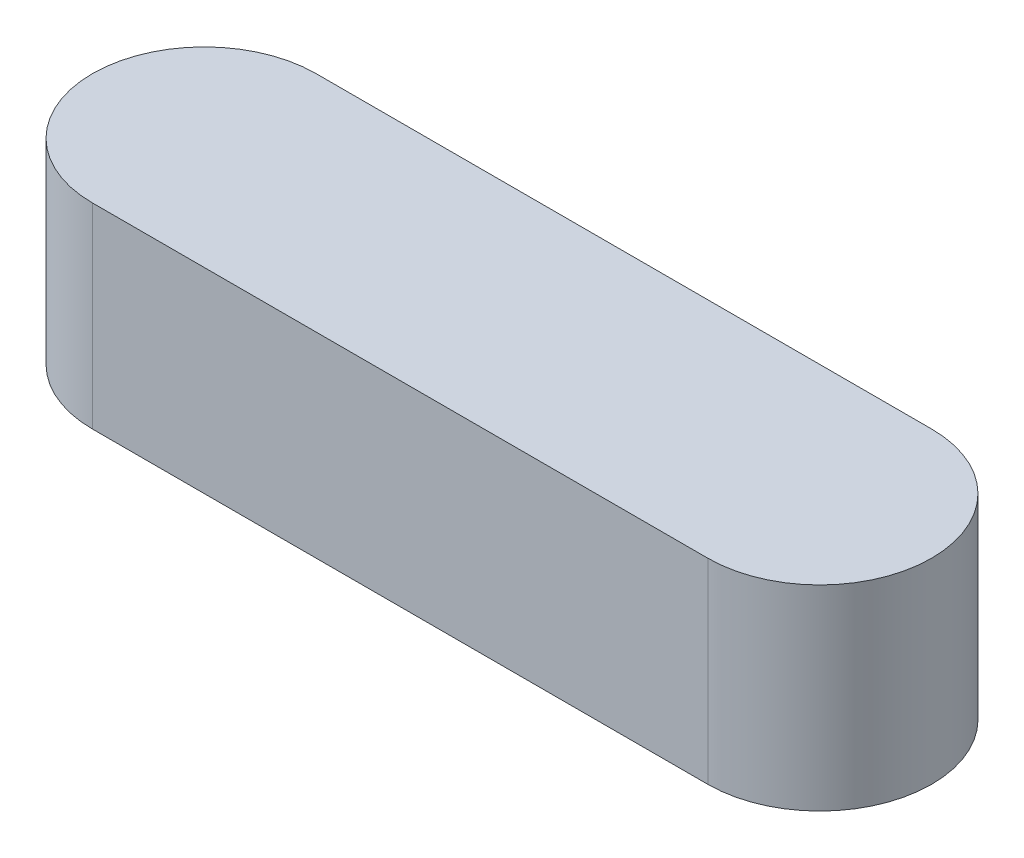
ISO-10303-21;
HEADER;
FILE_DESCRIPTION(('STEP AP214'),'2;1');
FILE_NAME('part.step','',(''),(''),'','','');
FILE_SCHEMA(('AUTOMOTIVE_DESIGN { 1 0 10303 214 1 1 1 1 }'));
ENDSEC;
DATA;
#1=APPLICATION_CONTEXT('core data for automotive mechanical design processes');
#2=APPLICATION_PROTOCOL_DEFINITION('international standard','automotive_design',2000,#1);
#3=PRODUCT_CONTEXT('',#1,'mechanical');
#4=PRODUCT('Part','Part','',(#3));
#5=PRODUCT_RELATED_PRODUCT_CATEGORY('part','',(#4));
#6=PRODUCT_DEFINITION_FORMATION('','',#4);
#7=PRODUCT_DEFINITION_CONTEXT('part definition',#1,'design');
#8=PRODUCT_DEFINITION('design','',#6,#7);
#9=PRODUCT_DEFINITION_SHAPE('','',#8);
#10=(LENGTH_UNIT() NAMED_UNIT(*) SI_UNIT(.MILLI.,.METRE.));
#11=(NAMED_UNIT(*) PLANE_ANGLE_UNIT() SI_UNIT($,.RADIAN.));
#12=(NAMED_UNIT(*) SI_UNIT($,.STERADIAN.) SOLID_ANGLE_UNIT());
#13=UNCERTAINTY_MEASURE_WITH_UNIT(LENGTH_MEASURE(1.E-05),#10,'distance_accuracy_value','');
#14=(GEOMETRIC_REPRESENTATION_CONTEXT(3) GLOBAL_UNCERTAINTY_ASSIGNED_CONTEXT((#13)) GLOBAL_UNIT_ASSIGNED_CONTEXT((#10,
#11,#12)) REPRESENTATION_CONTEXT('',''));
#15=CARTESIAN_POINT('',(0.,0.,0.));
#16=DIRECTION('',(0.,0.,1.));
#17=DIRECTION('',(1.,0.,0.));
#18=AXIS2_PLACEMENT_3D('',#15,#16,#17);
#19=CARTESIAN_POINT('',(0.,7.,0.));
#20=DIRECTION('',(0.,-1.,0.));
#21=DIRECTION('',(0.,0.,-1.));
#22=AXIS2_PLACEMENT_3D('',#19,#20,#21);
#23=CYLINDRICAL_SURFACE('',#22,4.);
#24=CARTESIAN_POINT('',(0.,0.,0.));
#25=DIRECTION('',(0.,1.,0.));
#26=DIRECTION('',(0.,0.,1.));
#27=AXIS2_PLACEMENT_3D('',#24,#25,#26);
#28=CIRCLE('',#27,4.);
#29=CARTESIAN_POINT('',(0.,0.,-4.));
#30=VERTEX_POINT('',#29);
#31=CARTESIAN_POINT('',(0.,0.,4.));
#32=VERTEX_POINT('',#31);
#33=EDGE_CURVE('E70',#30,#32,#28,.T.);
#34=ORIENTED_EDGE('',*,*,#33,.T.);
#35=DIRECTION('',(0.,-1.,0.));
#36=VECTOR('',#35,1.);
#37=CARTESIAN_POINT('',(0.,7.,4.));
#38=LINE('',#37,#36);
#39=CARTESIAN_POINT('',(0.,7.,4.));
#40=VERTEX_POINT('',#39);
#41=EDGE_CURVE('E11',#40,#32,#38,.T.);
#42=ORIENTED_EDGE('',*,*,#41,.F.);
#43=CARTESIAN_POINT('',(0.,7.,0.));
#44=DIRECTION('',(0.,1.,0.));
#45=DIRECTION('',(0.,0.,1.));
#46=AXIS2_PLACEMENT_3D('',#43,#44,#45);
#47=CIRCLE('',#46,4.);
#48=CARTESIAN_POINT('',(0.,7.,-4.));
#49=VERTEX_POINT('',#48);
#50=EDGE_CURVE('E88',#49,#40,#47,.T.);
#51=ORIENTED_EDGE('',*,*,#50,.F.);
#52=DIRECTION('',(0.,-1.,0.));
#53=VECTOR('',#52,1.);
#54=CARTESIAN_POINT('',(0.,7.,-4.));
#55=LINE('',#54,#53);
#56=EDGE_CURVE('E82',#49,#30,#55,.T.);
#57=ORIENTED_EDGE('',*,*,#56,.T.);
#58=EDGE_LOOP('',(#34,#42,#51,#57));
#59=FACE_BOUND('',#58,.T.);
#60=ADVANCED_FACE('F26',(#59),#23,.T.);
#61=CARTESIAN_POINT('',(0.,7.,4.));
#62=DIRECTION('',(0.,0.,-1.));
#63=DIRECTION('',(-1.,0.,0.));
#64=AXIS2_PLACEMENT_3D('',#61,#62,#63);
#65=PLANE('',#64);
#66=DIRECTION('',(1.,0.,0.));
#67=VECTOR('',#66,1.);
#68=CARTESIAN_POINT('',(0.,0.,4.));
#69=LINE('',#68,#67);
#70=CARTESIAN_POINT('',(22.,0.,4.));
#71=VERTEX_POINT('',#70);
#72=EDGE_CURVE('E66',#32,#71,#69,.T.);
#73=ORIENTED_EDGE('',*,*,#72,.T.);
#74=DIRECTION('',(0.,-1.,0.));
#75=VECTOR('',#74,1.);
#76=CARTESIAN_POINT('',(22.,7.,4.));
#77=LINE('',#76,#75);
#78=CARTESIAN_POINT('',(22.,7.,4.));
#79=VERTEX_POINT('',#78);
#80=EDGE_CURVE('E33',#79,#71,#77,.T.);
#81=ORIENTED_EDGE('',*,*,#80,.F.);
#82=DIRECTION('',(1.,0.,0.));
#83=VECTOR('',#82,1.);
#84=CARTESIAN_POINT('',(0.,7.,4.));
#85=LINE('',#84,#83);
#86=EDGE_CURVE('E78',#40,#79,#85,.T.);
#87=ORIENTED_EDGE('',*,*,#86,.F.);
#88=ORIENTED_EDGE('',*,*,#41,.T.);
#89=EDGE_LOOP('',(#73,#81,#87,#88));
#90=FACE_BOUND('',#89,.T.);
#91=ADVANCED_FACE('F77',(#90),#65,.F.);
#92=CARTESIAN_POINT('',(22.,7.,0.));
#93=DIRECTION('',(0.,-1.,0.));
#94=DIRECTION('',(0.,0.,-1.));
#95=AXIS2_PLACEMENT_3D('',#92,#93,#94);
#96=CYLINDRICAL_SURFACE('',#95,4.);
#97=CARTESIAN_POINT('',(22.,0.,0.));
#98=DIRECTION('',(0.,1.,0.));
#99=DIRECTION('',(0.,0.,1.));
#100=AXIS2_PLACEMENT_3D('',#97,#98,#99);
#101=CIRCLE('',#100,4.);
#102=CARTESIAN_POINT('',(22.,0.,-4.));
#103=VERTEX_POINT('',#102);
#104=EDGE_CURVE('E71',#71,#103,#101,.T.);
#105=ORIENTED_EDGE('',*,*,#104,.T.);
#106=DIRECTION('',(0.,-1.,0.));
#107=VECTOR('',#106,1.);
#108=CARTESIAN_POINT('',(22.,7.,-4.));
#109=LINE('',#108,#107);
#110=CARTESIAN_POINT('',(22.,7.,-4.));
#111=VERTEX_POINT('',#110);
#112=EDGE_CURVE('E94',#111,#103,#109,.T.);
#113=ORIENTED_EDGE('',*,*,#112,.F.);
#114=CARTESIAN_POINT('',(22.,7.,0.));
#115=DIRECTION('',(0.,1.,0.));
#116=DIRECTION('',(0.,0.,1.));
#117=AXIS2_PLACEMENT_3D('',#114,#115,#116);
#118=CIRCLE('',#117,4.);
#119=EDGE_CURVE('E45',#79,#111,#118,.T.);
#120=ORIENTED_EDGE('',*,*,#119,.F.);
#121=ORIENTED_EDGE('',*,*,#80,.T.);
#122=EDGE_LOOP('',(#105,#113,#120,#121));
#123=FACE_BOUND('',#122,.T.);
#124=ADVANCED_FACE('F97',(#123),#96,.T.);
#125=CARTESIAN_POINT('',(0.,7.,-4.));
#126=DIRECTION('',(0.,0.,1.));
#127=DIRECTION('',(1.,0.,0.));
#128=AXIS2_PLACEMENT_3D('',#125,#126,#127);
#129=PLANE('',#128);
#130=DIRECTION('',(-1.,0.,0.));
#131=VECTOR('',#130,1.);
#132=CARTESIAN_POINT('',(0.,0.,-4.));
#133=LINE('',#132,#131);
#134=EDGE_CURVE('E86',#103,#30,#133,.T.);
#135=ORIENTED_EDGE('',*,*,#134,.T.);
#136=ORIENTED_EDGE('',*,*,#56,.F.);
#137=DIRECTION('',(-1.,0.,0.));
#138=VECTOR('',#137,1.);
#139=CARTESIAN_POINT('',(0.,7.,-4.));
#140=LINE('',#139,#138);
#141=EDGE_CURVE('E40',#111,#49,#140,.T.);
#142=ORIENTED_EDGE('',*,*,#141,.F.);
#143=ORIENTED_EDGE('',*,*,#112,.T.);
#144=EDGE_LOOP('',(#135,#136,#142,#143));
#145=FACE_BOUND('',#144,.T.);
#146=ADVANCED_FACE('F99',(#145),#129,.F.);
#147=CARTESIAN_POINT('',(0.,7.,0.));
#148=DIRECTION('',(0.,1.,0.));
#149=DIRECTION('',(0.,0.,1.));
#150=AXIS2_PLACEMENT_3D('',#147,#148,#149);
#151=PLANE('',#150);
#152=ORIENTED_EDGE('',*,*,#50,.T.);
#153=ORIENTED_EDGE('',*,*,#86,.T.);
#154=ORIENTED_EDGE('',*,*,#119,.T.);
#155=ORIENTED_EDGE('',*,*,#141,.T.);
#156=EDGE_LOOP('',(#152,#153,#154,#155));
#157=FACE_BOUND('',#156,.T.);
#158=ADVANCED_FACE('F100',(#157),#151,.T.);
#159=CARTESIAN_POINT('',(0.,0.,0.));
#160=DIRECTION('',(0.,1.,0.));
#161=DIRECTION('',(0.,0.,1.));
#162=AXIS2_PLACEMENT_3D('',#159,#160,#161);
#163=PLANE('',#162);
#164=ORIENTED_EDGE('',*,*,#33,.F.);
#165=ORIENTED_EDGE('',*,*,#134,.F.);
#166=ORIENTED_EDGE('',*,*,#104,.F.);
#167=ORIENTED_EDGE('',*,*,#72,.F.);
#168=EDGE_LOOP('',(#164,#165,#166,#167));
#169=FACE_BOUND('',#168,.T.);
#170=ADVANCED_FACE('F67',(#169),#163,.F.);
#171=CLOSED_SHELL('',(#60,#91,#124,#146,#158,#170));
#172=MANIFOLD_SOLID_BREP('B2',#171);
#173=ADVANCED_BREP_SHAPE_REPRESENTATION('',(#18,#172),#14);
#174=SHAPE_DEFINITION_REPRESENTATION(#9,#173);
ENDSEC;
END-ISO-10303-21;
